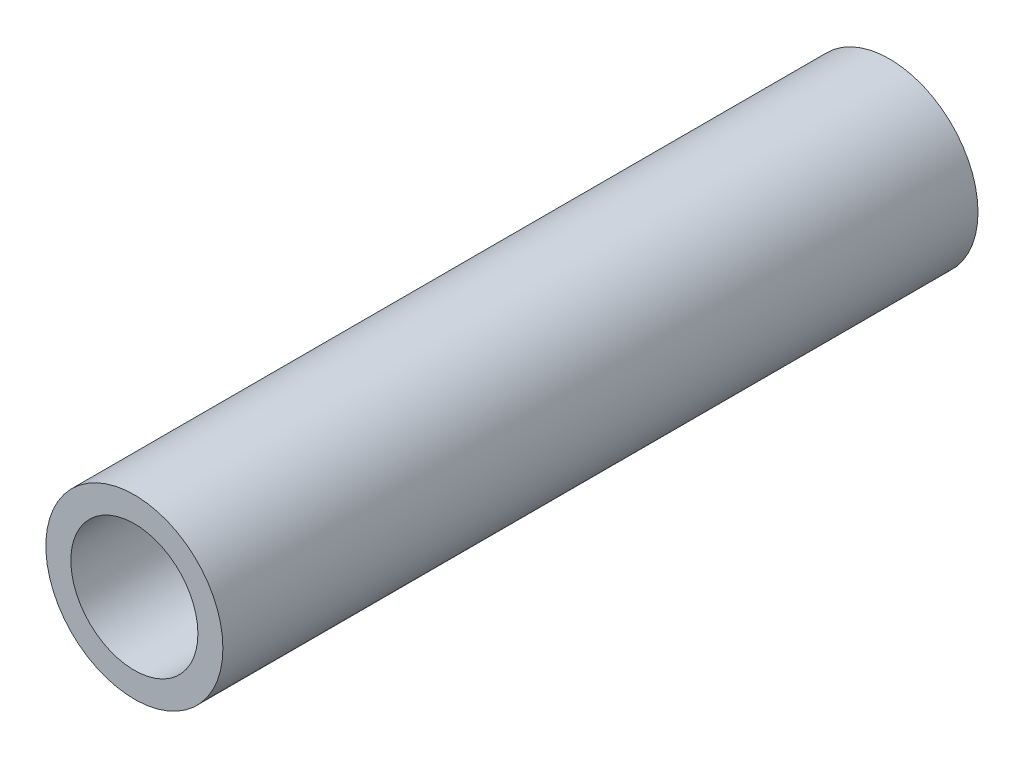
ISO-10303-21;
HEADER;
FILE_DESCRIPTION(('STEP AP214'),'2;1');
FILE_NAME('part.step','',(''),(''),'','','');
FILE_SCHEMA(('AUTOMOTIVE_DESIGN { 1 0 10303 214 1 1 1 1 }'));
ENDSEC;
DATA;
#1=APPLICATION_CONTEXT('core data for automotive mechanical design processes');
#2=APPLICATION_PROTOCOL_DEFINITION('international standard','automotive_design',2000,#1);
#3=PRODUCT_CONTEXT('',#1,'mechanical');
#4=PRODUCT('Part','Part','',(#3));
#5=PRODUCT_RELATED_PRODUCT_CATEGORY('part','',(#4));
#6=PRODUCT_DEFINITION_FORMATION('','',#4);
#7=PRODUCT_DEFINITION_CONTEXT('part definition',#1,'design');
#8=PRODUCT_DEFINITION('design','',#6,#7);
#9=PRODUCT_DEFINITION_SHAPE('','',#8);
#10=(LENGTH_UNIT() NAMED_UNIT(*) SI_UNIT(.MILLI.,.METRE.));
#11=(NAMED_UNIT(*) PLANE_ANGLE_UNIT() SI_UNIT($,.RADIAN.));
#12=(NAMED_UNIT(*) SI_UNIT($,.STERADIAN.) SOLID_ANGLE_UNIT());
#13=UNCERTAINTY_MEASURE_WITH_UNIT(LENGTH_MEASURE(1.E-05),#10,'distance_accuracy_value','');
#14=(GEOMETRIC_REPRESENTATION_CONTEXT(3) GLOBAL_UNCERTAINTY_ASSIGNED_CONTEXT((#13)) GLOBAL_UNIT_ASSIGNED_CONTEXT((#10,
#11,#12)) REPRESENTATION_CONTEXT('',''));
#15=CARTESIAN_POINT('',(0.,0.,0.));
#16=DIRECTION('',(0.,0.,1.));
#17=DIRECTION('',(1.,0.,0.));
#18=AXIS2_PLACEMENT_3D('',#15,#16,#17);
#19=CARTESIAN_POINT('',(0.,0.,92.075));
#20=DIRECTION('',(0.,0.,1.));
#21=DIRECTION('',(1.,0.,0.));
#22=AXIS2_PLACEMENT_3D('',#19,#20,#21);
#23=PLANE('',#22);
#24=CARTESIAN_POINT('',(0.,0.,92.075));
#25=DIRECTION('',(0.,0.,1.));
#26=DIRECTION('',(1.,0.,0.));
#27=AXIS2_PLACEMENT_3D('',#24,#25,#26);
#28=CIRCLE('',#27,10.795);
#29=CARTESIAN_POINT('',(10.795,0.,92.075));
#30=VERTEX_POINT('',#29);
#31=EDGE_CURVE('E10',#30,#30,#28,.T.);
#32=ORIENTED_EDGE('',*,*,#31,.T.);
#33=EDGE_LOOP('',(#32));
#34=FACE_BOUND('',#33,.T.);
#35=CARTESIAN_POINT('',(0.,0.,92.075));
#36=DIRECTION('',(0.,0.,1.));
#37=DIRECTION('',(1.,0.,0.));
#38=AXIS2_PLACEMENT_3D('',#35,#36,#37);
#39=CIRCLE('',#38,7.747);
#40=CARTESIAN_POINT('',(7.747,0.,92.075));
#41=VERTEX_POINT('',#40);
#42=EDGE_CURVE('E48',#41,#41,#39,.T.);
#43=ORIENTED_EDGE('',*,*,#42,.F.);
#44=EDGE_LOOP('',(#43));
#45=FACE_BOUND('',#44,.T.);
#46=ADVANCED_FACE('F37',(#34,#45),#23,.T.);
#47=CARTESIAN_POINT('',(0.,0.,0.));
#48=DIRECTION('',(0.,0.,1.));
#49=DIRECTION('',(1.,0.,0.));
#50=AXIS2_PLACEMENT_3D('',#47,#48,#49);
#51=PLANE('',#50);
#52=CARTESIAN_POINT('',(0.,0.,0.));
#53=DIRECTION('',(0.,0.,1.));
#54=DIRECTION('',(1.,0.,0.));
#55=AXIS2_PLACEMENT_3D('',#52,#53,#54);
#56=CIRCLE('',#55,10.795);
#57=CARTESIAN_POINT('',(10.795,0.,0.));
#58=VERTEX_POINT('',#57);
#59=EDGE_CURVE('E41',#58,#58,#56,.T.);
#60=ORIENTED_EDGE('',*,*,#59,.F.);
#61=EDGE_LOOP('',(#60));
#62=FACE_BOUND('',#61,.T.);
#63=CARTESIAN_POINT('',(0.,0.,0.));
#64=DIRECTION('',(0.,0.,1.));
#65=DIRECTION('',(1.,0.,0.));
#66=AXIS2_PLACEMENT_3D('',#63,#64,#65);
#67=CIRCLE('',#66,7.747);
#68=CARTESIAN_POINT('',(7.747,0.,0.));
#69=VERTEX_POINT('',#68);
#70=EDGE_CURVE('E50',#69,#69,#67,.T.);
#71=ORIENTED_EDGE('',*,*,#70,.T.);
#72=EDGE_LOOP('',(#71));
#73=FACE_BOUND('',#72,.T.);
#74=ADVANCED_FACE('F60',(#62,#73),#51,.F.);
#75=CARTESIAN_POINT('',(0.,0.,92.075));
#76=DIRECTION('',(0.,0.,-1.));
#77=DIRECTION('',(-1.,0.,0.));
#78=AXIS2_PLACEMENT_3D('',#75,#76,#77);
#79=CYLINDRICAL_SURFACE('',#78,10.795);
#80=ORIENTED_EDGE('',*,*,#31,.F.);
#81=EDGE_LOOP('',(#80));
#82=FACE_BOUND('',#81,.T.);
#83=ORIENTED_EDGE('',*,*,#59,.T.);
#84=EDGE_LOOP('',(#83));
#85=FACE_BOUND('',#84,.T.);
#86=ADVANCED_FACE('F39',(#82,#85),#79,.T.);
#87=CARTESIAN_POINT('',(0.,0.,92.075));
#88=DIRECTION('',(0.,0.,-1.));
#89=DIRECTION('',(-1.,0.,0.));
#90=AXIS2_PLACEMENT_3D('',#87,#88,#89);
#91=CYLINDRICAL_SURFACE('',#90,7.747);
#92=ORIENTED_EDGE('',*,*,#42,.T.);
#93=EDGE_LOOP('',(#92));
#94=FACE_BOUND('',#93,.T.);
#95=ORIENTED_EDGE('',*,*,#70,.F.);
#96=EDGE_LOOP('',(#95));
#97=FACE_BOUND('',#96,.T.);
#98=ADVANCED_FACE('F56',(#94,#97),#91,.F.);
#99=CLOSED_SHELL('',(#46,#74,#86,#98));
#100=MANIFOLD_SOLID_BREP('B2',#99);
#101=ADVANCED_BREP_SHAPE_REPRESENTATION('',(#18,#100),#14);
#102=SHAPE_DEFINITION_REPRESENTATION(#9,#101);
ENDSEC;
END-ISO-10303-21;
